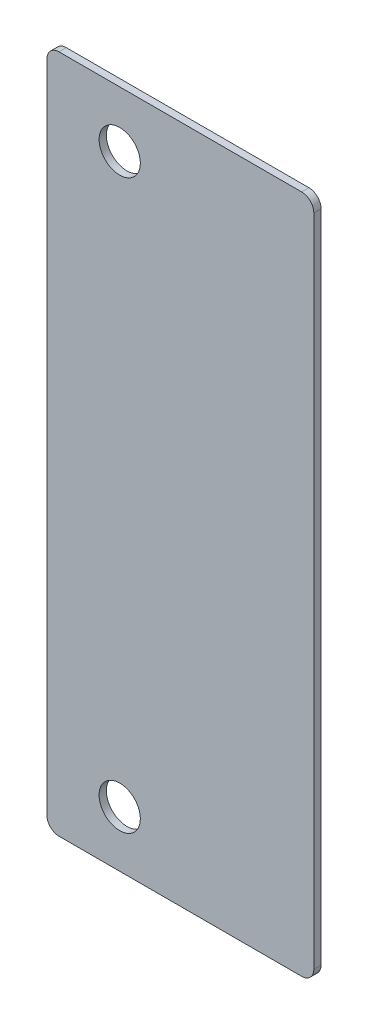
ISO-10303-21;
HEADER;
FILE_DESCRIPTION(('STEP AP214'),'2;1');
FILE_NAME('part.step','',(''),(''),'','','');
FILE_SCHEMA(('AUTOMOTIVE_DESIGN { 1 0 10303 214 1 1 1 1 }'));
ENDSEC;
DATA;
#1=APPLICATION_CONTEXT('core data for automotive mechanical design processes');
#2=APPLICATION_PROTOCOL_DEFINITION('international standard','automotive_design',2000,#1);
#3=PRODUCT_CONTEXT('',#1,'mechanical');
#4=PRODUCT('Part','Part','',(#3));
#5=PRODUCT_RELATED_PRODUCT_CATEGORY('part','',(#4));
#6=PRODUCT_DEFINITION_FORMATION('','',#4);
#7=PRODUCT_DEFINITION_CONTEXT('part definition',#1,'design');
#8=PRODUCT_DEFINITION('design','',#6,#7);
#9=PRODUCT_DEFINITION_SHAPE('','',#8);
#10=(LENGTH_UNIT() NAMED_UNIT(*) SI_UNIT(.MILLI.,.METRE.));
#11=(NAMED_UNIT(*) PLANE_ANGLE_UNIT() SI_UNIT($,.RADIAN.));
#12=(NAMED_UNIT(*) SI_UNIT($,.STERADIAN.) SOLID_ANGLE_UNIT());
#13=UNCERTAINTY_MEASURE_WITH_UNIT(LENGTH_MEASURE(1.E-05),#10,'distance_accuracy_value','');
#14=(GEOMETRIC_REPRESENTATION_CONTEXT(3) GLOBAL_UNCERTAINTY_ASSIGNED_CONTEXT((#13)) GLOBAL_UNIT_ASSIGNED_CONTEXT((#10,
#11,#12)) REPRESENTATION_CONTEXT('',''));
#15=CARTESIAN_POINT('',(0.,0.,0.));
#16=DIRECTION('',(0.,0.,1.));
#17=DIRECTION('',(1.,0.,0.));
#18=AXIS2_PLACEMENT_3D('',#15,#16,#17);
#19=CARTESIAN_POINT('',(2.5,137.5,1.49999999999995));
#20=DIRECTION('',(0.,0.,-1.));
#21=DIRECTION('',(-1.,0.,0.));
#22=AXIS2_PLACEMENT_3D('',#19,#20,#21);
#23=PLANE('',#22);
#24=CARTESIAN_POINT('',(15.,128.5,1.49999999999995));
#25=DIRECTION('',(0.,0.,1.));
#26=DIRECTION('',(1.,0.,0.));
#27=AXIS2_PLACEMENT_3D('',#24,#25,#26);
#28=CIRCLE('',#27,4.25);
#29=CARTESIAN_POINT('',(19.25,128.5,1.49999999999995));
#30=VERTEX_POINT('',#29);
#31=EDGE_CURVE('E145',#30,#30,#28,.T.);
#32=ORIENTED_EDGE('',*,*,#31,.F.);
#33=EDGE_LOOP('',(#32));
#34=FACE_BOUND('',#33,.T.);
#35=CARTESIAN_POINT('',(2.5,137.5,1.49999999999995));
#36=DIRECTION('',(0.,0.,1.));
#37=DIRECTION('',(-1.,0.,0.));
#38=AXIS2_PLACEMENT_3D('',#35,#36,#37);
#39=CIRCLE('',#38,2.5);
#40=CARTESIAN_POINT('',(2.5,140.,1.49999999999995));
#41=VERTEX_POINT('',#40);
#42=CARTESIAN_POINT('',(0.,137.5,1.49999999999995));
#43=VERTEX_POINT('',#42);
#44=EDGE_CURVE('E161',#41,#43,#39,.T.);
#45=ORIENTED_EDGE('',*,*,#44,.T.);
#46=DIRECTION('',(0.,-1.,0.));
#47=VECTOR('',#46,1.);
#48=CARTESIAN_POINT('',(0.,2.49999999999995,1.49999999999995));
#49=LINE('',#48,#47);
#50=CARTESIAN_POINT('',(0.,2.49999999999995,1.49999999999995));
#51=VERTEX_POINT('',#50);
#52=EDGE_CURVE('E97',#43,#51,#49,.T.);
#53=ORIENTED_EDGE('',*,*,#52,.T.);
#54=CARTESIAN_POINT('',(2.5,2.49999999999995,1.49999999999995));
#55=DIRECTION('',(0.,0.,1.));
#56=DIRECTION('',(-1.,0.,0.));
#57=AXIS2_PLACEMENT_3D('',#54,#55,#56);
#58=CIRCLE('',#57,2.5);
#59=CARTESIAN_POINT('',(2.5,0.,1.49999999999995));
#60=VERTEX_POINT('',#59);
#61=EDGE_CURVE('E182',#51,#60,#58,.T.);
#62=ORIENTED_EDGE('',*,*,#61,.T.);
#63=DIRECTION('',(1.,0.,0.));
#64=VECTOR('',#63,1.);
#65=CARTESIAN_POINT('',(2.5,0.,1.49999999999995));
#66=LINE('',#65,#64);
#67=CARTESIAN_POINT('',(52.5,0.,1.49999999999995));
#68=VERTEX_POINT('',#67);
#69=EDGE_CURVE('E196',#60,#68,#66,.T.);
#70=ORIENTED_EDGE('',*,*,#69,.T.);
#71=CARTESIAN_POINT('',(52.5,2.49999999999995,1.49999999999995));
#72=DIRECTION('',(0.,0.,1.));
#73=DIRECTION('',(1.,0.,0.));
#74=AXIS2_PLACEMENT_3D('',#71,#72,#73);
#75=CIRCLE('',#74,2.5);
#76=CARTESIAN_POINT('',(55.,2.49999999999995,1.49999999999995));
#77=VERTEX_POINT('',#76);
#78=EDGE_CURVE('E116',#68,#77,#75,.T.);
#79=ORIENTED_EDGE('',*,*,#78,.T.);
#80=DIRECTION('',(0.,1.,0.));
#81=VECTOR('',#80,1.);
#82=CARTESIAN_POINT('',(55.,2.49999999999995,1.49999999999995));
#83=LINE('',#82,#81);
#84=CARTESIAN_POINT('',(55.,137.5,1.49999999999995));
#85=VERTEX_POINT('',#84);
#86=EDGE_CURVE('E110',#77,#85,#83,.T.);
#87=ORIENTED_EDGE('',*,*,#86,.T.);
#88=CARTESIAN_POINT('',(52.5,137.5,1.49999999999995));
#89=DIRECTION('',(0.,0.,1.));
#90=DIRECTION('',(-1.,0.,0.));
#91=AXIS2_PLACEMENT_3D('',#88,#89,#90);
#92=CIRCLE('',#91,2.5);
#93=CARTESIAN_POINT('',(52.5,140.,1.49999999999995));
#94=VERTEX_POINT('',#93);
#95=EDGE_CURVE('E114',#85,#94,#92,.T.);
#96=ORIENTED_EDGE('',*,*,#95,.T.);
#97=DIRECTION('',(-1.,0.,0.));
#98=VECTOR('',#97,1.);
#99=CARTESIAN_POINT('',(2.5,140.,1.49999999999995));
#100=LINE('',#99,#98);
#101=EDGE_CURVE('E54',#94,#41,#100,.T.);
#102=ORIENTED_EDGE('',*,*,#101,.T.);
#103=EDGE_LOOP('',(#45,#53,#62,#70,#79,#87,#96,#102));
#104=FACE_BOUND('',#103,.T.);
#105=CARTESIAN_POINT('',(15.,11.5000000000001,1.49999999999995));
#106=DIRECTION('',(0.,0.,1.));
#107=DIRECTION('',(1.,0.,0.));
#108=AXIS2_PLACEMENT_3D('',#105,#106,#107);
#109=CIRCLE('',#108,4.25);
#110=CARTESIAN_POINT('',(19.25,11.5000000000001,1.49999999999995));
#111=VERTEX_POINT('',#110);
#112=EDGE_CURVE('E210',#111,#111,#109,.T.);
#113=ORIENTED_EDGE('',*,*,#112,.F.);
#114=EDGE_LOOP('',(#113));
#115=FACE_BOUND('',#114,.T.);
#116=ADVANCED_FACE('F36',(#34,#104,#115),#23,.F.);
#117=CARTESIAN_POINT('',(2.5,137.5,0.));
#118=DIRECTION('',(0.,0.,-1.));
#119=DIRECTION('',(-1.,0.,0.));
#120=AXIS2_PLACEMENT_3D('',#117,#118,#119);
#121=PLANE('',#120);
#122=CARTESIAN_POINT('',(15.,128.5,0.));
#123=DIRECTION('',(0.,0.,1.));
#124=DIRECTION('',(1.,0.,0.));
#125=AXIS2_PLACEMENT_3D('',#122,#123,#124);
#126=CIRCLE('',#125,4.25);
#127=CARTESIAN_POINT('',(19.25,128.5,0.));
#128=VERTEX_POINT('',#127);
#129=EDGE_CURVE('E206',#128,#128,#126,.T.);
#130=ORIENTED_EDGE('',*,*,#129,.T.);
#131=EDGE_LOOP('',(#130));
#132=FACE_BOUND('',#131,.T.);
#133=CARTESIAN_POINT('',(2.5,137.5,0.));
#134=DIRECTION('',(0.,0.,1.));
#135=DIRECTION('',(-1.,0.,0.));
#136=AXIS2_PLACEMENT_3D('',#133,#134,#135);
#137=CIRCLE('',#136,2.5);
#138=CARTESIAN_POINT('',(2.5,140.,0.));
#139=VERTEX_POINT('',#138);
#140=CARTESIAN_POINT('',(0.,137.5,0.));
#141=VERTEX_POINT('',#140);
#142=EDGE_CURVE('E140',#139,#141,#137,.T.);
#143=ORIENTED_EDGE('',*,*,#142,.F.);
#144=DIRECTION('',(-1.,0.,0.));
#145=VECTOR('',#144,1.);
#146=CARTESIAN_POINT('',(2.5,140.,0.));
#147=LINE('',#146,#145);
#148=CARTESIAN_POINT('',(52.5,140.,0.));
#149=VERTEX_POINT('',#148);
#150=EDGE_CURVE('E89',#149,#139,#147,.T.);
#151=ORIENTED_EDGE('',*,*,#150,.F.);
#152=CARTESIAN_POINT('',(52.5,137.5,0.));
#153=DIRECTION('',(0.,0.,1.));
#154=DIRECTION('',(-1.,0.,0.));
#155=AXIS2_PLACEMENT_3D('',#152,#153,#154);
#156=CIRCLE('',#155,2.5);
#157=CARTESIAN_POINT('',(55.,137.5,0.));
#158=VERTEX_POINT('',#157);
#159=EDGE_CURVE('E83',#158,#149,#156,.T.);
#160=ORIENTED_EDGE('',*,*,#159,.F.);
#161=DIRECTION('',(0.,1.,0.));
#162=VECTOR('',#161,1.);
#163=CARTESIAN_POINT('',(55.,2.49999999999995,0.));
#164=LINE('',#163,#162);
#165=CARTESIAN_POINT('',(55.,2.49999999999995,0.));
#166=VERTEX_POINT('',#165);
#167=EDGE_CURVE('E125',#166,#158,#164,.T.);
#168=ORIENTED_EDGE('',*,*,#167,.F.);
#169=CARTESIAN_POINT('',(52.5,2.49999999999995,0.));
#170=DIRECTION('',(0.,0.,1.));
#171=DIRECTION('',(1.,0.,0.));
#172=AXIS2_PLACEMENT_3D('',#169,#170,#171);
#173=CIRCLE('',#172,2.5);
#174=CARTESIAN_POINT('',(52.5,0.,0.));
#175=VERTEX_POINT('',#174);
#176=EDGE_CURVE('E153',#175,#166,#173,.T.);
#177=ORIENTED_EDGE('',*,*,#176,.F.);
#178=DIRECTION('',(1.,0.,0.));
#179=VECTOR('',#178,1.);
#180=CARTESIAN_POINT('',(2.5,0.,0.));
#181=LINE('',#180,#179);
#182=CARTESIAN_POINT('',(2.5,0.,0.));
#183=VERTEX_POINT('',#182);
#184=EDGE_CURVE('E151',#183,#175,#181,.T.);
#185=ORIENTED_EDGE('',*,*,#184,.F.);
#186=CARTESIAN_POINT('',(2.5,2.49999999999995,0.));
#187=DIRECTION('',(0.,0.,1.));
#188=DIRECTION('',(-1.,0.,0.));
#189=AXIS2_PLACEMENT_3D('',#186,#187,#188);
#190=CIRCLE('',#189,2.5);
#191=CARTESIAN_POINT('',(0.,2.49999999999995,0.));
#192=VERTEX_POINT('',#191);
#193=EDGE_CURVE('E148',#192,#183,#190,.T.);
#194=ORIENTED_EDGE('',*,*,#193,.F.);
#195=DIRECTION('',(0.,-1.,0.));
#196=VECTOR('',#195,1.);
#197=CARTESIAN_POINT('',(0.,2.49999999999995,0.));
#198=LINE('',#197,#196);
#199=EDGE_CURVE('E144',#141,#192,#198,.T.);
#200=ORIENTED_EDGE('',*,*,#199,.F.);
#201=EDGE_LOOP('',(#143,#151,#160,#168,#177,#185,#194,#200));
#202=FACE_BOUND('',#201,.T.);
#203=CARTESIAN_POINT('',(15.,11.5000000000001,0.));
#204=DIRECTION('',(0.,0.,1.));
#205=DIRECTION('',(1.,0.,0.));
#206=AXIS2_PLACEMENT_3D('',#203,#204,#205);
#207=CIRCLE('',#206,4.25);
#208=CARTESIAN_POINT('',(19.25,11.5000000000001,0.));
#209=VERTEX_POINT('',#208);
#210=EDGE_CURVE('E214',#209,#209,#207,.T.);
#211=ORIENTED_EDGE('',*,*,#210,.T.);
#212=EDGE_LOOP('',(#211));
#213=FACE_BOUND('',#212,.T.);
#214=ADVANCED_FACE('F186',(#132,#202,#213),#121,.T.);
#215=CARTESIAN_POINT('',(2.5,137.5,1.49999999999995));
#216=DIRECTION('',(0.,0.,-1.));
#217=DIRECTION('',(-1.,0.,0.));
#218=AXIS2_PLACEMENT_3D('',#215,#216,#217);
#219=CYLINDRICAL_SURFACE('',#218,2.5);
#220=ORIENTED_EDGE('',*,*,#142,.T.);
#221=DIRECTION('',(0.,0.,-1.));
#222=VECTOR('',#221,1.);
#223=CARTESIAN_POINT('',(0.,137.5,1.49999999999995));
#224=LINE('',#223,#222);
#225=EDGE_CURVE('E11',#43,#141,#224,.T.);
#226=ORIENTED_EDGE('',*,*,#225,.F.);
#227=ORIENTED_EDGE('',*,*,#44,.F.);
#228=DIRECTION('',(0.,0.,-1.));
#229=VECTOR('',#228,1.);
#230=CARTESIAN_POINT('',(2.5,140.,1.49999999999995));
#231=LINE('',#230,#229);
#232=EDGE_CURVE('E136',#41,#139,#231,.T.);
#233=ORIENTED_EDGE('',*,*,#232,.T.);
#234=EDGE_LOOP('',(#220,#226,#227,#233));
#235=FACE_BOUND('',#234,.T.);
#236=ADVANCED_FACE('F38',(#235),#219,.T.);
#237=CARTESIAN_POINT('',(0.,2.49999999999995,1.49999999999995));
#238=DIRECTION('',(1.,0.,0.));
#239=DIRECTION('',(0.,0.,-1.));
#240=AXIS2_PLACEMENT_3D('',#237,#238,#239);
#241=PLANE('',#240);
#242=ORIENTED_EDGE('',*,*,#199,.T.);
#243=DIRECTION('',(0.,0.,-1.));
#244=VECTOR('',#243,1.);
#245=CARTESIAN_POINT('',(0.,2.49999999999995,1.49999999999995));
#246=LINE('',#245,#244);
#247=EDGE_CURVE('E46',#51,#192,#246,.T.);
#248=ORIENTED_EDGE('',*,*,#247,.F.);
#249=ORIENTED_EDGE('',*,*,#52,.F.);
#250=ORIENTED_EDGE('',*,*,#225,.T.);
#251=EDGE_LOOP('',(#242,#248,#249,#250));
#252=FACE_BOUND('',#251,.T.);
#253=ADVANCED_FACE('F249',(#252),#241,.F.);
#254=CARTESIAN_POINT('',(2.5,2.49999999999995,1.49999999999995));
#255=DIRECTION('',(0.,0.,-1.));
#256=DIRECTION('',(-1.,0.,0.));
#257=AXIS2_PLACEMENT_3D('',#254,#255,#256);
#258=CYLINDRICAL_SURFACE('',#257,2.5);
#259=ORIENTED_EDGE('',*,*,#193,.T.);
#260=DIRECTION('',(0.,0.,-1.));
#261=VECTOR('',#260,1.);
#262=CARTESIAN_POINT('',(2.5,0.,1.49999999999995));
#263=LINE('',#262,#261);
#264=EDGE_CURVE('E172',#60,#183,#263,.T.);
#265=ORIENTED_EDGE('',*,*,#264,.F.);
#266=ORIENTED_EDGE('',*,*,#61,.F.);
#267=ORIENTED_EDGE('',*,*,#247,.T.);
#268=EDGE_LOOP('',(#259,#265,#266,#267));
#269=FACE_BOUND('',#268,.T.);
#270=ADVANCED_FACE('F180',(#269),#258,.T.);
#271=CARTESIAN_POINT('',(2.5,0.,1.49999999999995));
#272=DIRECTION('',(0.,1.,0.));
#273=DIRECTION('',(0.,0.,1.));
#274=AXIS2_PLACEMENT_3D('',#271,#272,#273);
#275=PLANE('',#274);
#276=ORIENTED_EDGE('',*,*,#184,.T.);
#277=DIRECTION('',(0.,0.,-1.));
#278=VECTOR('',#277,1.);
#279=CARTESIAN_POINT('',(52.5,0.,1.49999999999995));
#280=LINE('',#279,#278);
#281=EDGE_CURVE('E168',#68,#175,#280,.T.);
#282=ORIENTED_EDGE('',*,*,#281,.F.);
#283=ORIENTED_EDGE('',*,*,#69,.F.);
#284=ORIENTED_EDGE('',*,*,#264,.T.);
#285=EDGE_LOOP('',(#276,#282,#283,#284));
#286=FACE_BOUND('',#285,.T.);
#287=ADVANCED_FACE('F191',(#286),#275,.F.);
#288=CARTESIAN_POINT('',(52.5,2.49999999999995,1.49999999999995));
#289=DIRECTION('',(0.,0.,-1.));
#290=DIRECTION('',(-1.,0.,0.));
#291=AXIS2_PLACEMENT_3D('',#288,#289,#290);
#292=CYLINDRICAL_SURFACE('',#291,2.5);
#293=ORIENTED_EDGE('',*,*,#176,.T.);
#294=DIRECTION('',(0.,0.,-1.));
#295=VECTOR('',#294,1.);
#296=CARTESIAN_POINT('',(55.,2.49999999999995,1.49999999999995));
#297=LINE('',#296,#295);
#298=EDGE_CURVE('E127',#77,#166,#297,.T.);
#299=ORIENTED_EDGE('',*,*,#298,.F.);
#300=ORIENTED_EDGE('',*,*,#78,.F.);
#301=ORIENTED_EDGE('',*,*,#281,.T.);
#302=EDGE_LOOP('',(#293,#299,#300,#301));
#303=FACE_BOUND('',#302,.T.);
#304=ADVANCED_FACE('F194',(#303),#292,.T.);
#305=CARTESIAN_POINT('',(55.,2.49999999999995,1.49999999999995));
#306=DIRECTION('',(-1.,0.,0.));
#307=DIRECTION('',(0.,0.,1.));
#308=AXIS2_PLACEMENT_3D('',#305,#306,#307);
#309=PLANE('',#308);
#310=ORIENTED_EDGE('',*,*,#167,.T.);
#311=DIRECTION('',(0.,0.,-1.));
#312=VECTOR('',#311,1.);
#313=CARTESIAN_POINT('',(55.,137.5,1.49999999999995));
#314=LINE('',#313,#312);
#315=EDGE_CURVE('E122',#85,#158,#314,.T.);
#316=ORIENTED_EDGE('',*,*,#315,.F.);
#317=ORIENTED_EDGE('',*,*,#86,.F.);
#318=ORIENTED_EDGE('',*,*,#298,.T.);
#319=EDGE_LOOP('',(#310,#316,#317,#318));
#320=FACE_BOUND('',#319,.T.);
#321=ADVANCED_FACE('F123',(#320),#309,.F.);
#322=CARTESIAN_POINT('',(52.5,137.5,1.49999999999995));
#323=DIRECTION('',(0.,0.,-1.));
#324=DIRECTION('',(-1.,0.,0.));
#325=AXIS2_PLACEMENT_3D('',#322,#323,#324);
#326=CYLINDRICAL_SURFACE('',#325,2.5);
#327=ORIENTED_EDGE('',*,*,#159,.T.);
#328=DIRECTION('',(0.,0.,-1.));
#329=VECTOR('',#328,1.);
#330=CARTESIAN_POINT('',(52.5,140.,1.49999999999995));
#331=LINE('',#330,#329);
#332=EDGE_CURVE('E128',#94,#149,#331,.T.);
#333=ORIENTED_EDGE('',*,*,#332,.F.);
#334=ORIENTED_EDGE('',*,*,#95,.F.);
#335=ORIENTED_EDGE('',*,*,#315,.T.);
#336=EDGE_LOOP('',(#327,#333,#334,#335));
#337=FACE_BOUND('',#336,.T.);
#338=ADVANCED_FACE('F130',(#337),#326,.T.);
#339=CARTESIAN_POINT('',(2.5,140.,1.49999999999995));
#340=DIRECTION('',(0.,-1.,0.));
#341=DIRECTION('',(0.,0.,-1.));
#342=AXIS2_PLACEMENT_3D('',#339,#340,#341);
#343=PLANE('',#342);
#344=ORIENTED_EDGE('',*,*,#150,.T.);
#345=ORIENTED_EDGE('',*,*,#232,.F.);
#346=ORIENTED_EDGE('',*,*,#101,.F.);
#347=ORIENTED_EDGE('',*,*,#332,.T.);
#348=EDGE_LOOP('',(#344,#345,#346,#347));
#349=FACE_BOUND('',#348,.T.);
#350=ADVANCED_FACE('F237',(#349),#343,.F.);
#351=CARTESIAN_POINT('',(15.,128.5,1.49999999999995));
#352=DIRECTION('',(0.,0.,-1.));
#353=DIRECTION('',(-1.,0.,0.));
#354=AXIS2_PLACEMENT_3D('',#351,#352,#353);
#355=CYLINDRICAL_SURFACE('',#354,4.25);
#356=ORIENTED_EDGE('',*,*,#31,.T.);
#357=EDGE_LOOP('',(#356));
#358=FACE_BOUND('',#357,.T.);
#359=ORIENTED_EDGE('',*,*,#129,.F.);
#360=EDGE_LOOP('',(#359));
#361=FACE_BOUND('',#360,.T.);
#362=ADVANCED_FACE('F234',(#358,#361),#355,.F.);
#363=CARTESIAN_POINT('',(15.,11.5000000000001,1.49999999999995));
#364=DIRECTION('',(0.,0.,-1.));
#365=DIRECTION('',(-1.,0.,0.));
#366=AXIS2_PLACEMENT_3D('',#363,#364,#365);
#367=CYLINDRICAL_SURFACE('',#366,4.25);
#368=ORIENTED_EDGE('',*,*,#112,.T.);
#369=EDGE_LOOP('',(#368));
#370=FACE_BOUND('',#369,.T.);
#371=ORIENTED_EDGE('',*,*,#210,.F.);
#372=EDGE_LOOP('',(#371));
#373=FACE_BOUND('',#372,.T.);
#374=ADVANCED_FACE('F222',(#370,#373),#367,.F.);
#375=CLOSED_SHELL('',(#116,#214,#236,#253,#270,#287,#304,#321,#338,#350,#362,#374));
#376=MANIFOLD_SOLID_BREP('B2',#375);
#377=ADVANCED_BREP_SHAPE_REPRESENTATION('',(#18,#376),#14);
#378=SHAPE_DEFINITION_REPRESENTATION(#9,#377);
ENDSEC;
END-ISO-10303-21;
